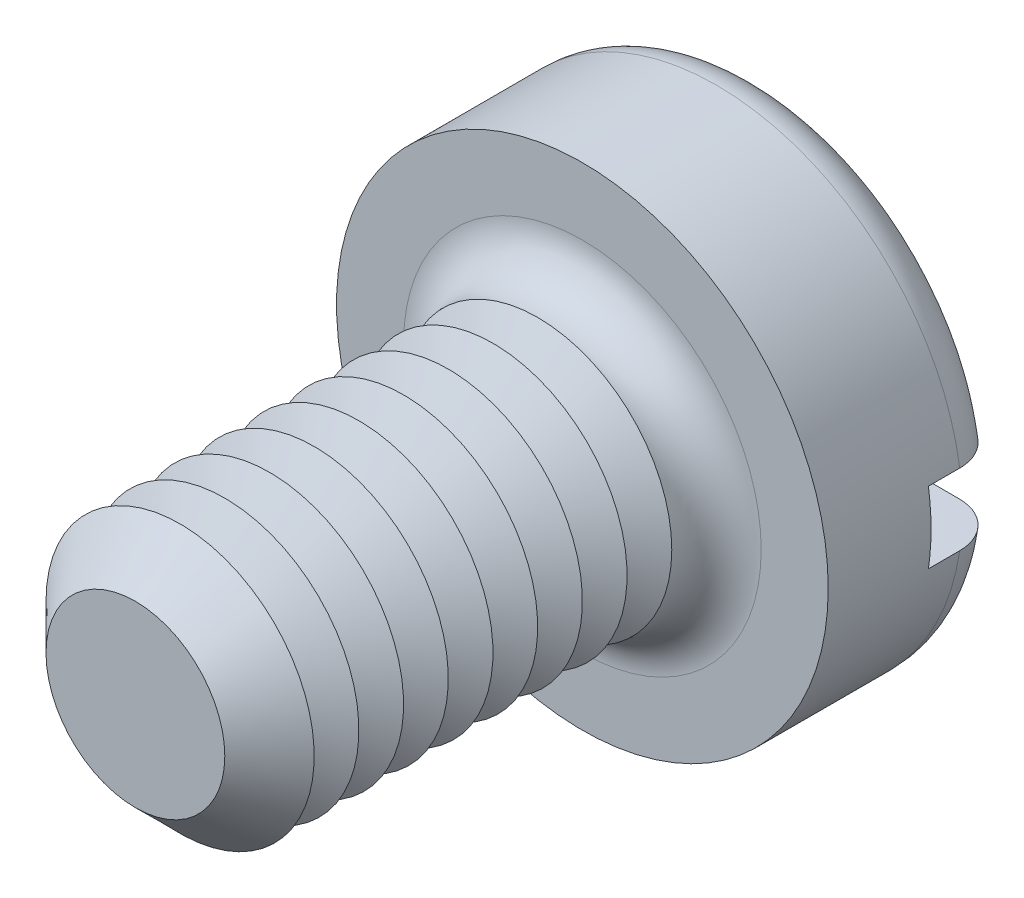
ISO-10303-21;
HEADER;
FILE_DESCRIPTION(('STEP AP214'),'2;1');
FILE_NAME('part.step','',(''),(''),'','','');
FILE_SCHEMA(('AUTOMOTIVE_DESIGN { 1 0 10303 214 1 1 1 1 }'));
ENDSEC;
DATA;
#1=APPLICATION_CONTEXT('core data for automotive mechanical design processes');
#2=APPLICATION_PROTOCOL_DEFINITION('international standard','automotive_design',2000,#1);
#3=PRODUCT_CONTEXT('',#1,'mechanical');
#4=PRODUCT('Part','Part','',(#3));
#5=PRODUCT_RELATED_PRODUCT_CATEGORY('part','',(#4));
#6=PRODUCT_DEFINITION_FORMATION('','',#4);
#7=PRODUCT_DEFINITION_CONTEXT('part definition',#1,'design');
#8=PRODUCT_DEFINITION('design','',#6,#7);
#9=PRODUCT_DEFINITION_SHAPE('','',#8);
#10=(LENGTH_UNIT() NAMED_UNIT(*) SI_UNIT(.MILLI.,.METRE.));
#11=(NAMED_UNIT(*) PLANE_ANGLE_UNIT() SI_UNIT($,.RADIAN.));
#12=(NAMED_UNIT(*) SI_UNIT($,.STERADIAN.) SOLID_ANGLE_UNIT());
#13=UNCERTAINTY_MEASURE_WITH_UNIT(LENGTH_MEASURE(1.E-05),#10,'distance_accuracy_value','');
#14=(GEOMETRIC_REPRESENTATION_CONTEXT(3) GLOBAL_UNCERTAINTY_ASSIGNED_CONTEXT((#13)) GLOBAL_UNIT_ASSIGNED_CONTEXT((#10,
#11,#12)) REPRESENTATION_CONTEXT('',''));
#15=CARTESIAN_POINT('',(0.,0.,0.));
#16=DIRECTION('',(0.,0.,1.));
#17=DIRECTION('',(1.,0.,0.));
#18=AXIS2_PLACEMENT_3D('',#15,#16,#17);
#19=CARTESIAN_POINT('',(0.,0.,-2.));
#20=DIRECTION('',(0.,0.,1.));
#21=DIRECTION('',(1.,0.,0.));
#22=AXIS2_PLACEMENT_3D('',#19,#20,#21);
#23=PLANE('',#22);
#24=CARTESIAN_POINT('',(0.,0.,-2.));
#25=DIRECTION('',(0.,0.,1.));
#26=DIRECTION('',(1.,0.,0.));
#27=AXIS2_PLACEMENT_3D('',#24,#25,#26);
#28=CIRCLE('',#27,2.25);
#29=CARTESIAN_POINT('',(-2.21415898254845,0.4,-2.));
#30=VERTEX_POINT('',#29);
#31=CARTESIAN_POINT('',(2.21415898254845,0.4,-2.));
#32=VERTEX_POINT('',#31);
#33=EDGE_CURVE('E116',#30,#32,#28,.F.);
#34=ORIENTED_EDGE('',*,*,#33,.T.);
#35=DIRECTION('',(1.,0.,0.));
#36=VECTOR('',#35,1.);
#37=CARTESIAN_POINT('',(-2.75,0.400000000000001,-2.));
#38=LINE('',#37,#36);
#39=EDGE_CURVE('E111',#30,#32,#38,.T.);
#40=ORIENTED_EDGE('',*,*,#39,.F.);
#41=EDGE_LOOP('',(#34,#40));
#42=FACE_BOUND('',#41,.T.);
#43=ADVANCED_FACE('F39',(#42),#23,.F.);
#44=CARTESIAN_POINT('',(0.,0.,-1.5));
#45=DIRECTION('',(0.,0.,1.));
#46=DIRECTION('',(1.,0.,0.));
#47=AXIS2_PLACEMENT_3D('',#44,#45,#46);
#48=TOROIDAL_SURFACE('',#47,2.25,0.5);
#49=CARTESIAN_POINT('',(-2.6296588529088,0.400000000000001,-1.78631483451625));
#50=CARTESIAN_POINT('',(-2.61332846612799,0.400000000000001,-1.80942627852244));
#51=CARTESIAN_POINT('',(-2.59501593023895,0.400000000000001,-1.83116426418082));
#52=CARTESIAN_POINT('',(-2.55497423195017,0.400000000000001,-1.87126271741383));
#53=CARTESIAN_POINT('',(-2.53324055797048,0.4,-1.88961865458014));
#54=CARTESIAN_POINT('',(-2.48702796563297,0.4,-1.92241505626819));
#55=CARTESIAN_POINT('',(-2.46255183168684,0.4,-1.93685944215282));
#56=CARTESIAN_POINT('',(-2.41154731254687,0.4,-1.96147315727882));
#57=CARTESIAN_POINT('',(-2.38501943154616,0.4,-1.97164353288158));
#58=CARTESIAN_POINT('',(-2.3303912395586,0.4,-1.98753780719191));
#59=CARTESIAN_POINT('',(-2.30227842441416,0.4,-1.99321871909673));
#60=CARTESIAN_POINT('',(-2.24549884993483,0.4,-1.99984170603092));
#61=CARTESIAN_POINT('',(-2.21683202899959,0.4,-2.00078325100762));
#62=CARTESIAN_POINT('',(-2.15939326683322,0.4,-1.99790249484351));
#63=CARTESIAN_POINT('',(-2.13062419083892,0.4,-1.99402290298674));
#64=CARTESIAN_POINT('',(-2.07413526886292,0.4,-1.98151915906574));
#65=CARTESIAN_POINT('',(-2.04641547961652,0.4,-1.97289475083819));
#66=CARTESIAN_POINT('',(-1.99264697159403,0.4,-1.95107177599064));
#67=CARTESIAN_POINT('',(-1.96660904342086,0.4,-1.93784659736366));
#68=CARTESIAN_POINT('',(-1.91713954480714,0.4,-1.90718730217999));
#69=CARTESIAN_POINT('',(-1.89370795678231,0.4,-1.88975321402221));
#70=CARTESIAN_POINT('',(-1.85029144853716,0.4,-1.85126548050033));
#71=CARTESIAN_POINT('',(-1.83028607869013,0.4,-1.83023492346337));
#72=CARTESIAN_POINT('',(-1.79417432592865,0.4,-1.78505552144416));
#73=CARTESIAN_POINT('',(-1.77806752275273,0.4,-1.76090701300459));
#74=CARTESIAN_POINT('',(-1.75056079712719,0.4,-1.71067721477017));
#75=CARTESIAN_POINT('',(-1.7390748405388,0.4,-1.68464306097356));
#76=CARTESIAN_POINT('',(-1.72075680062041,0.4,-1.63098625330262));
#77=CARTESIAN_POINT('',(-1.71392397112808,0.4,-1.60336385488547));
#78=CARTESIAN_POINT('',(-1.70525661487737,0.4,-1.54801066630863));
#79=CARTESIAN_POINT('',(-1.70330866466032,0.4,-1.52029759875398));
#80=CARTESIAN_POINT('',(-1.70414820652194,0.4,-1.46494458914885));
#81=CARTESIAN_POINT('',(-1.70693532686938,0.4,-1.43730464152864));
#82=CARTESIAN_POINT('',(-1.71709335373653,0.4,-1.38318389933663));
#83=CARTESIAN_POINT('',(-1.72441580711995,0.4,-1.35669397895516));
#84=CARTESIAN_POINT('',(-1.74335830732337,0.4,-1.30529964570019));
#85=CARTESIAN_POINT('',(-1.75497853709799,0.4,-1.2803953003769));
#86=CARTESIAN_POINT('',(-1.78229453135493,0.4,-1.23258298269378));
#87=CARTESIAN_POINT('',(-1.79803217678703,0.4,-1.20969896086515));
#88=CARTESIAN_POINT('',(-1.83304498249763,0.4,-1.16682064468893));
#89=CARTESIAN_POINT('',(-1.85232054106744,0.4,-1.1468266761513));
#90=CARTESIAN_POINT('',(-1.89433695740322,0.4,-1.10980713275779));
#91=CARTESIAN_POINT('',(-1.91714740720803,0.4,-1.09286053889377));
#92=CARTESIAN_POINT('',(-1.96524407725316,0.4,-1.06294809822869));
#93=CARTESIAN_POINT('',(-1.99053056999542,0.4,-1.04998269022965));
#94=CARTESIAN_POINT('',(-2.04340612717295,0.4,-1.02814800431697));
#95=CARTESIAN_POINT('',(-2.07103098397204,0.4,-1.01936532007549));
#96=CARTESIAN_POINT('',(-2.12735840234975,0.4,-1.00652373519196));
#97=CARTESIAN_POINT('',(-2.15606102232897,0.4,-1.00246509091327));
#98=CARTESIAN_POINT('',(-2.21395379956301,0.4,-0.999181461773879));
#99=CARTESIAN_POINT('',(-2.24314598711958,0.4,-0.999992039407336));
#100=CARTESIAN_POINT('',(-2.30097585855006,0.4,-1.00652779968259));
#101=CARTESIAN_POINT('',(-2.32961355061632,0.4,-1.01225290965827));
#102=CARTESIAN_POINT('',(-2.38536238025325,0.4,-1.02843951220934));
#103=CARTESIAN_POINT('',(-2.41248047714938,0.4,-1.03887701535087));
#104=CARTESIAN_POINT('',(-2.46454860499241,0.4,-1.06421009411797));
#105=CARTESIAN_POINT('',(-2.48949875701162,0.4,-1.0791054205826));
#106=CARTESIAN_POINT('',(-2.53620471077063,0.4,-1.11274531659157));
#107=CARTESIAN_POINT('',(-2.55799482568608,0.400000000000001,-1.1314422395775));
#108=CARTESIAN_POINT('',(-2.59807595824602,0.400000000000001,-1.17227176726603));
#109=CARTESIAN_POINT('',(-2.6163672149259,0.400000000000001,-1.19440413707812));
#110=CARTESIAN_POINT('',(-2.64868581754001,0.400000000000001,-1.24117072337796));
#111=CARTESIAN_POINT('',(-2.66276466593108,0.400000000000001,-1.26576935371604));
#112=CARTESIAN_POINT('',(-2.68654482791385,0.400000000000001,-1.31699754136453));
#113=CARTESIAN_POINT('',(-2.69624657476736,0.400000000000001,-1.34362689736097));
#114=CARTESIAN_POINT('',(-2.71090527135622,0.400000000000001,-1.39787706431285));
#115=CARTESIAN_POINT('',(-2.71590826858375,0.400000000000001,-1.4254854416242));
#116=CARTESIAN_POINT('',(-2.72118463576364,0.400000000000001,-1.48115803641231));
#117=CARTESIAN_POINT('',(-2.72145696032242,0.400000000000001,-1.50922235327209));
#118=CARTESIAN_POINT('',(-2.71727180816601,0.400000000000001,-1.56487271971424));
#119=CARTESIAN_POINT('',(-2.71283440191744,0.400000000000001,-1.59246029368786));
#120=CARTESIAN_POINT('',(-2.69939521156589,0.400000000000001,-1.64647499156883));
#121=CARTESIAN_POINT('',(-2.69039909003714,0.400000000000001,-1.67290351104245));
#122=CARTESIAN_POINT('',(-2.67251693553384,0.400000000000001,-1.71382731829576));
#123=CARTESIAN_POINT('',(-2.66497994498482,0.400000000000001,-1.72892686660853));
#124=CARTESIAN_POINT('',(-2.64841616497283,0.400000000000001,-1.75828509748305));
#125=CARTESIAN_POINT('',(-2.63938938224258,0.400000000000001,-1.77254378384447));
#126=CARTESIAN_POINT('',(-2.6296588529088,0.400000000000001,-1.78631483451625));
#127=B_SPLINE_CURVE_WITH_KNOTS('',3,(#49,#50,#51,#52,#53,#54,#55,#56,#57,#58,#59,#60,#61,#62,
#63,#64,#65,#66,#67,#68,#69,#70,#71,#72,#73,#74,#75,#76,#77,#78,#79,#80,#81,#82,#83,#84,#85,#86,
#87,#88,#89,#90,#91,#92,#93,#94,#95,#96,#97,#98,#99,#100,#101,#102,#103,#104,#105,#106,#107,
#108,#109,#110,#111,#112,#113,#114,#115,#116,#117,#118,#119,#120,#121,#122,#123,#124,#125,#126),
.UNSPECIFIED.,.T.,.F.,(4,2,2,2,2,2,2,2,2,2,2,2,2,2,2,2,2,2,2,2,2,2,2,2,2,2,2,2,2,2,2,2,2,2,2,2,
2,2,4),(0.,0.0848338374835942,0.16978050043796,0.254641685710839,0.339482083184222,
0.42512530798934,0.510778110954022,0.597458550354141,0.684143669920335,0.771338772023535,
0.858533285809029,0.945187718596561,1.03183280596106,1.11678035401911,1.20171427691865,
1.28465703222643,1.36759327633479,1.4496584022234,1.53172702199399,1.61466526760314,
1.69761285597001,1.78247103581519,1.86733856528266,1.95389396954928,2.0404540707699,
2.12764713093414,2.21483890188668,2.30159172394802,2.38833969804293,2.4740609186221,
2.55977628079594,2.6443962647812,2.72900787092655,2.81278135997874,2.89657336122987,
2.98000971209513,3.06334267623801,3.113891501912,3.16444009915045),.UNSPECIFIED.);
#128=CARTESIAN_POINT('',(-2.72075357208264,0.400000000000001,-1.50000000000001));
#129=VERTEX_POINT('',#128);
#130=EDGE_CURVE('E243',#129,#30,#127,.T.);
#131=ORIENTED_EDGE('',*,*,#130,.F.);
#132=CARTESIAN_POINT('',(0.,0.,-1.5));
#133=DIRECTION('',(0.,0.,1.));
#134=DIRECTION('',(1.,0.,0.));
#135=AXIS2_PLACEMENT_3D('',#132,#133,#134);
#136=CIRCLE('',#135,2.75);
#137=CARTESIAN_POINT('',(2.7207535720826,0.4,-1.5));
#138=VERTEX_POINT('',#137);
#139=EDGE_CURVE('E125',#138,#129,#136,.T.);
#140=ORIENTED_EDGE('',*,*,#139,.F.);
#141=CARTESIAN_POINT('',(1.7362507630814,0.4,-1.6752840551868));
#142=CARTESIAN_POINT('',(1.74636083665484,0.4,-1.70159961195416));
#143=CARTESIAN_POINT('',(1.7587429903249,0.4,-1.72706707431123));
#144=CARTESIAN_POINT('',(1.78764414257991,0.4,-1.77556609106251));
#145=CARTESIAN_POINT('',(1.80416918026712,0.4,-1.79859401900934));
#146=CARTESIAN_POINT('',(1.84080454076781,0.4,-1.84153587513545));
#147=CARTESIAN_POINT('',(1.86090949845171,0.4,-1.86145438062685));
#148=CARTESIAN_POINT('',(1.9041208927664,0.4,-1.89769607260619));
#149=CARTESIAN_POINT('',(1.92722659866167,0.4,-1.91402013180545));
#150=CARTESIAN_POINT('',(1.97620958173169,0.4,-1.94291288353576));
#151=CARTESIAN_POINT('',(2.00212726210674,0.4,-1.95541309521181));
#152=CARTESIAN_POINT('',(2.05567603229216,0.4,-1.97595143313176));
#153=CARTESIAN_POINT('',(2.08330733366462,0.4,-1.98398900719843));
#154=CARTESIAN_POINT('',(2.13989163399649,0.4,-1.99545904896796));
#155=CARTESIAN_POINT('',(2.16885726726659,0.4,-1.99882930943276));
#156=CARTESIAN_POINT('',(2.22694412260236,0.4,-2.00065872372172));
#157=CARTESIAN_POINT('',(2.25606534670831,0.4,-1.99911781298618));
#158=CARTESIAN_POINT('',(2.31362436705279,0.4,-1.99114818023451));
#159=CARTESIAN_POINT('',(2.34206235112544,0.4,-1.98472081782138));
#160=CARTESIAN_POINT('',(2.39743709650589,0.4,-1.96713601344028));
#161=CARTESIAN_POINT('',(2.42437392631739,0.4,-1.95597878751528));
#162=CARTESIAN_POINT('',(2.47569769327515,0.4,-1.92935960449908));
#163=CARTESIAN_POINT('',(2.50010686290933,0.4,-1.91394052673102));
#164=CARTESIAN_POINT('',(2.54594525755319,0.4,-1.8791725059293));
#165=CARTESIAN_POINT('',(2.56737468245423,0.4,-1.85982382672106));
#166=CARTESIAN_POINT('',(2.60634898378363,0.4,-1.81801641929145));
#167=CARTESIAN_POINT('',(2.6239407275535,0.4,-1.79560138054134));
#168=CARTESIAN_POINT('',(2.65505953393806,0.4,-1.7481077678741));
#169=CARTESIAN_POINT('',(2.66858686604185,0.4,-1.72302937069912));
#170=CARTESIAN_POINT('',(2.69103536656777,0.4,-1.67123055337));
#171=CARTESIAN_POINT('',(2.70000740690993,0.4,-1.64453217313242));
#172=CARTESIAN_POINT('',(2.71330608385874,0.4,-1.59000262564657));
#173=CARTESIAN_POINT('',(2.71763293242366,0.4,-1.5621715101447));
#174=CARTESIAN_POINT('',(2.72149675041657,0.4,-1.50637655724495));
#175=CARTESIAN_POINT('',(2.72106725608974,0.4,-1.47841503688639));
#176=CARTESIAN_POINT('',(2.7155123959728,0.4,-1.42296287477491));
#177=CARTESIAN_POINT('',(2.71038711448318,0.4,-1.39547222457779));
#178=CARTESIAN_POINT('',(2.69560462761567,0.4,-1.34178071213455));
#179=CARTESIAN_POINT('',(2.68595389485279,0.4,-1.31557806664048));
#180=CARTESIAN_POINT('',(2.66240876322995,0.4,-1.26515516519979));
#181=CARTESIAN_POINT('',(2.64851431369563,0.4,-1.24093493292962));
#182=CARTESIAN_POINT('',(2.61681930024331,0.4,-1.19504594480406));
#183=CARTESIAN_POINT('',(2.59900198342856,0.4,-1.17338876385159));
#184=CARTESIAN_POINT('',(2.56001495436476,0.4,-1.13333899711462));
#185=CARTESIAN_POINT('',(2.53884510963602,0.4,-1.11494654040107));
#186=CARTESIAN_POINT('',(2.49354554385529,0.4,-1.08175888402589));
#187=CARTESIAN_POINT('',(2.46938991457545,0.4,-1.06699905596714));
#188=CARTESIAN_POINT('',(2.41896725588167,0.4,-1.04168682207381));
#189=CARTESIAN_POINT('',(2.39270009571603,0.4,-1.03113467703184));
#190=CARTESIAN_POINT('',(2.33844927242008,0.4,-1.01439607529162));
#191=CARTESIAN_POINT('',(2.31044823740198,0.4,-1.00826592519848));
#192=CARTESIAN_POINT('',(2.25381752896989,0.4,-1.00073183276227));
#193=CARTESIAN_POINT('',(2.22518781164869,0.4,-0.999328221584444));
#194=CARTESIAN_POINT('',(2.16774231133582,0.4,-1.00127811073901));
#195=CARTESIAN_POINT('',(2.13892848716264,0.4,-1.00468955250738));
#196=CARTESIAN_POINT('',(2.08227193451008,0.4,-1.01626887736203));
#197=CARTESIAN_POINT('',(2.05442926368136,0.4,-1.02443704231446));
#198=CARTESIAN_POINT('',(2.00032604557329,0.4,-1.04537295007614));
#199=CARTESIAN_POINT('',(1.97407661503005,0.4,-1.05816944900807));
#200=CARTESIAN_POINT('',(1.92411255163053,0.4,-1.08801035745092));
#201=CARTESIAN_POINT('',(1.90039792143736,0.4,-1.10505477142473));
#202=CARTESIAN_POINT('',(1.85633574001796,0.4,-1.14282887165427));
#203=CARTESIAN_POINT('',(1.83597040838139,0.4,-1.16353779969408));
#204=CARTESIAN_POINT('',(1.79908731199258,0.4,-1.20813793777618));
#205=CARTESIAN_POINT('',(1.78256899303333,0.4,-1.23202868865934));
#206=CARTESIAN_POINT('',(1.75420022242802,0.4,-1.28183173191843));
#207=CARTESIAN_POINT('',(1.74226635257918,0.4,-1.30769648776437));
#208=CARTESIAN_POINT('',(1.72302798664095,0.4,-1.36110211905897));
#209=CARTESIAN_POINT('',(1.71572395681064,0.4,-1.38864316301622));
#210=CARTESIAN_POINT('',(1.70611974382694,0.4,-1.44392326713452));
#211=CARTESIAN_POINT('',(1.70370764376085,0.4,-1.47164298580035));
#212=CARTESIAN_POINT('',(1.70363822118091,0.4,-1.52706336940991));
#213=CARTESIAN_POINT('',(1.70597448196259,0.4,-1.55476400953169));
#214=CARTESIAN_POINT('',(1.71335146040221,0.4,-1.59796127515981));
#215=CARTESIAN_POINT('',(1.71686033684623,0.4,-1.61373520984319));
#216=CARTESIAN_POINT('',(1.7254146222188,0.4,-1.64486018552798));
#217=CARTESIAN_POINT('',(1.73045999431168,0.4,-1.66021123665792));
#218=CARTESIAN_POINT('',(1.7362507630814,0.4,-1.6752840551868));
#219=B_SPLINE_CURVE_WITH_KNOTS('',3,(#141,#142,#143,#144,#145,#146,#147,#148,#149,#150,#151,
#152,#153,#154,#155,#156,#157,#158,#159,#160,#161,#162,#163,#164,#165,#166,#167,#168,#169,#170,
#171,#172,#173,#174,#175,#176,#177,#178,#179,#180,#181,#182,#183,#184,#185,#186,#187,#188,#189,
#190,#191,#192,#193,#194,#195,#196,#197,#198,#199,#200,#201,#202,#203,#204,#205,#206,#207,#208,
#209,#210,#211,#212,#213,#214,#215,#216,#217,#218),.UNSPECIFIED.,.T.,.F.,(4,2,2,2,2,2,2,2,2,2,2,
2,2,2,2,2,2,2,2,2,2,2,2,2,2,2,2,2,2,2,2,2,2,2,2,2,2,2,4),(0.,0.0845117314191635,
0.169147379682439,0.253657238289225,0.338146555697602,0.424070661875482,0.510005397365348,
0.597074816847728,0.684145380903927,0.771191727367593,0.858234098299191,0.94443074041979,
1.03062159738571,1.11569223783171,1.20075723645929,1.28485012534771,1.36893917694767,
1.45243570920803,1.53593074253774,1.61930671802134,1.70268368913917,1.7864238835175,
1.87016738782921,1.95469664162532,2.03923113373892,2.12482389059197,2.21042264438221,
2.29706026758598,2.38370302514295,2.47089361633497,2.55808429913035,2.64479602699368,
2.73149525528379,2.81653234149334,2.9015779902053,2.98465497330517,3.06761976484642,
3.11602689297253,3.164432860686),.UNSPECIFIED.);
#220=EDGE_CURVE('E245',#32,#138,#219,.T.);
#221=ORIENTED_EDGE('',*,*,#220,.F.);
#222=ORIENTED_EDGE('',*,*,#33,.F.);
#223=EDGE_LOOP('',(#131,#140,#221,#222));
#224=FACE_BOUND('',#223,.T.);
#225=ADVANCED_FACE('F227',(#224),#48,.T.);
#226=CARTESIAN_POINT('',(0.,0.,-2.));
#227=DIRECTION('',(0.,0.,1.));
#228=DIRECTION('',(1.,0.,0.));
#229=AXIS2_PLACEMENT_3D('',#226,#227,#228);
#230=CYLINDRICAL_SURFACE('',#229,2.75);
#231=DIRECTION('',(0.,0.,1.));
#232=VECTOR('',#231,1.);
#233=CARTESIAN_POINT('',(2.72075357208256,0.4,-2.));
#234=LINE('',#233,#232);
#235=CARTESIAN_POINT('',(2.72075357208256,0.4,-1.15));
#236=VERTEX_POINT('',#235);
#237=EDGE_CURVE('E259',#138,#236,#234,.T.);
#238=ORIENTED_EDGE('',*,*,#237,.F.);
#239=ORIENTED_EDGE('',*,*,#139,.T.);
#240=DIRECTION('',(0.,0.,1.));
#241=VECTOR('',#240,1.);
#242=CARTESIAN_POINT('',(-2.72075357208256,0.4,-2.));
#243=LINE('',#242,#241);
#244=CARTESIAN_POINT('',(-2.72075357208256,0.4,-1.15));
#245=VERTEX_POINT('',#244);
#246=EDGE_CURVE('E63',#245,#129,#243,.F.);
#247=ORIENTED_EDGE('',*,*,#246,.F.);
#248=CARTESIAN_POINT('',(0.,0.,-1.15));
#249=DIRECTION('',(0.,0.,-1.));
#250=DIRECTION('',(-1.,0.,0.));
#251=AXIS2_PLACEMENT_3D('',#248,#249,#250);
#252=CIRCLE('',#251,2.75);
#253=CARTESIAN_POINT('',(-2.72075357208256,-0.4,-1.15));
#254=VERTEX_POINT('',#253);
#255=EDGE_CURVE('E43',#245,#254,#252,.F.);
#256=ORIENTED_EDGE('',*,*,#255,.T.);
#257=DIRECTION('',(0.,0.,1.));
#258=VECTOR('',#257,1.);
#259=CARTESIAN_POINT('',(-2.72075357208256,-0.4,-2.));
#260=LINE('',#259,#258);
#261=CARTESIAN_POINT('',(-2.72075357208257,-0.4,-1.5));
#262=VERTEX_POINT('',#261);
#263=EDGE_CURVE('E256',#262,#254,#260,.T.);
#264=ORIENTED_EDGE('',*,*,#263,.F.);
#265=CARTESIAN_POINT('',(2.72075357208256,-0.4,-1.5));
#266=VERTEX_POINT('',#265);
#267=EDGE_CURVE('E127',#262,#266,#136,.T.);
#268=ORIENTED_EDGE('',*,*,#267,.T.);
#269=DIRECTION('',(0.,0.,1.));
#270=VECTOR('',#269,1.);
#271=CARTESIAN_POINT('',(2.72075357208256,-0.4,-2.));
#272=LINE('',#271,#270);
#273=CARTESIAN_POINT('',(2.72075357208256,-0.4,-1.15));
#274=VERTEX_POINT('',#273);
#275=EDGE_CURVE('E55',#274,#266,#272,.F.);
#276=ORIENTED_EDGE('',*,*,#275,.F.);
#277=EDGE_CURVE('E11',#274,#236,#252,.F.);
#278=ORIENTED_EDGE('',*,*,#277,.T.);
#279=EDGE_LOOP('',(#238,#239,#247,#256,#264,#268,#276,#278));
#280=FACE_BOUND('',#279,.T.);
#281=CARTESIAN_POINT('',(0.,0.,0.));
#282=DIRECTION('',(0.,0.,1.));
#283=DIRECTION('',(1.,0.,0.));
#284=AXIS2_PLACEMENT_3D('',#281,#282,#283);
#285=CIRCLE('',#284,2.75);
#286=CARTESIAN_POINT('',(2.75,0.,0.));
#287=VERTEX_POINT('',#286);
#288=EDGE_CURVE('E262',#287,#287,#285,.T.);
#289=ORIENTED_EDGE('',*,*,#288,.F.);
#290=EDGE_LOOP('',(#289));
#291=FACE_BOUND('',#290,.T.);
#292=ADVANCED_FACE('F223',(#280,#291),#230,.T.);
#293=CARTESIAN_POINT('',(2.21415898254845,-0.4,-2.));
#294=VERTEX_POINT('',#293);
#295=CARTESIAN_POINT('',(-2.21415898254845,-0.4,-2.));
#296=VERTEX_POINT('',#295);
#297=EDGE_CURVE('E109',#294,#296,#28,.F.);
#298=ORIENTED_EDGE('',*,*,#297,.T.);
#299=DIRECTION('',(-1.,0.,0.));
#300=VECTOR('',#299,1.);
#301=CARTESIAN_POINT('',(-2.75,-0.4,-2.));
#302=LINE('',#301,#300);
#303=EDGE_CURVE('E96',#294,#296,#302,.T.);
#304=ORIENTED_EDGE('',*,*,#303,.F.);
#305=EDGE_LOOP('',(#298,#304));
#306=FACE_BOUND('',#305,.T.);
#307=ADVANCED_FACE('F108',(#306),#23,.F.);
#308=CARTESIAN_POINT('',(0.,0.,0.));
#309=DIRECTION('',(0.,0.,1.));
#310=DIRECTION('',(1.,0.,0.));
#311=AXIS2_PLACEMENT_3D('',#308,#309,#310);
#312=PLANE('',#311);
#313=CARTESIAN_POINT('',(0.,0.,0.));
#314=DIRECTION('',(0.,0.,1.));
#315=DIRECTION('',(1.,0.,0.));
#316=AXIS2_PLACEMENT_3D('',#313,#314,#315);
#317=CIRCLE('',#316,2.);
#318=CARTESIAN_POINT('',(2.,0.,0.));
#319=VERTEX_POINT('',#318);
#320=EDGE_CURVE('E115',#319,#319,#317,.F.);
#321=ORIENTED_EDGE('',*,*,#320,.T.);
#322=EDGE_LOOP('',(#321));
#323=FACE_BOUND('',#322,.T.);
#324=ORIENTED_EDGE('',*,*,#288,.T.);
#325=EDGE_LOOP('',(#324));
#326=FACE_BOUND('',#325,.T.);
#327=ADVANCED_FACE('F222',(#323,#326),#312,.T.);
#328=CARTESIAN_POINT('',(-2.6296588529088,-0.4,-1.78631483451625));
#329=CARTESIAN_POINT('',(-2.64575286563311,-0.4,-1.76353353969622));
#330=CARTESIAN_POINT('',(-2.65994473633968,-0.4,-1.73938506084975));
#331=CARTESIAN_POINT('',(-2.68408879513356,-0.4,-1.68903091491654));
#332=CARTESIAN_POINT('',(-2.69403633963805,-0.4,-1.6628230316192));
#333=CARTESIAN_POINT('',(-2.70937899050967,-0.4,-1.60911025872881));
#334=CARTESIAN_POINT('',(-2.71477511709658,-0.4,-1.5816056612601));
#335=CARTESIAN_POINT('',(-2.72085365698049,-0.4,-1.52608718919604));
#336=CARTESIAN_POINT('',(-2.7215371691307,-0.4,-1.49807343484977));
#337=CARTESIAN_POINT('',(-2.71817903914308,-0.4,-1.44242333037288));
#338=CARTESIAN_POINT('',(-2.71415291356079,-0.4,-1.41478604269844));
#339=CARTESIAN_POINT('',(-2.70152104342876,-0.4,-1.36057835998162));
#340=CARTESIAN_POINT('',(-2.69291517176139,-0.4,-1.33400799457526));
#341=CARTESIAN_POINT('',(-2.67137052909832,-0.4,-1.28266198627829));
#342=CARTESIAN_POINT('',(-2.65842829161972,-0.4,-1.25788779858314));
#343=CARTESIAN_POINT('',(-2.62859348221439,-0.4,-1.21084577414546));
#344=CARTESIAN_POINT('',(-2.61170082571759,-0.4,-1.18857799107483));
#345=CARTESIAN_POINT('',(-2.5743351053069,-0.4,-1.1470221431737));
#346=CARTESIAN_POINT('',(-2.55383974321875,-0.4,-1.12775413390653));
#347=CARTESIAN_POINT('',(-2.5099353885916,-0.4,-1.09288845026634));
#348=CARTESIAN_POINT('',(-2.48652625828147,-0.4,-1.07729094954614));
#349=CARTESIAN_POINT('',(-2.43718903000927,-0.4,-1.0500239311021));
#350=CARTESIAN_POINT('',(-2.41123629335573,-0.4,-1.0383990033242));
#351=CARTESIAN_POINT('',(-2.35776417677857,-0.4,-1.01960886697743));
#352=CARTESIAN_POINT('',(-2.33024469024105,-0.4,-1.01244396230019));
#353=CARTESIAN_POINT('',(-2.27404134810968,-0.4,-1.00268156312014));
#354=CARTESIAN_POINT('',(-2.24534705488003,-0.4,-1.00014414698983));
#355=CARTESIAN_POINT('',(-2.18793513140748,-0.4,-0.999867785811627));
#356=CARTESIAN_POINT('',(-2.15921749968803,-0.4,-1.00212917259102));
#357=CARTESIAN_POINT('',(-2.10225052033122,-0.4,-1.01142552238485));
#358=CARTESIAN_POINT('',(-2.07400941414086,-0.4,-1.01851105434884));
#359=CARTESIAN_POINT('',(-2.01911044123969,-0.4,-1.03730994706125));
#360=CARTESIAN_POINT('',(-1.99245264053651,-0.4,-1.04902350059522));
#361=CARTESIAN_POINT('',(-1.94142108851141,-0.4,-1.07679847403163));
#362=CARTESIAN_POINT('',(-1.91705303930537,-0.4,-1.09287038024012));
#363=CARTESIAN_POINT('',(-1.87139758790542,-0.4,-1.12891897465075));
#364=CARTESIAN_POINT('',(-1.85011007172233,-0.4,-1.14889551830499));
#365=CARTESIAN_POINT('',(-1.81149058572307,-0.4,-1.19196940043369));
#366=CARTESIAN_POINT('',(-1.79411779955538,-0.4,-1.21503011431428));
#367=CARTESIAN_POINT('',(-1.76359546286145,-0.4,-1.26379588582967));
#368=CARTESIAN_POINT('',(-1.75044532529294,-0.4,-1.28950057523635));
#369=CARTESIAN_POINT('',(-1.72906221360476,-0.4,-1.3422057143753));
#370=CARTESIAN_POINT('',(-1.72072512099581,-0.4,-1.3691639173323));
#371=CARTESIAN_POINT('',(-1.70880448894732,-0.4,-1.42411084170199));
#372=CARTESIAN_POINT('',(-1.7052202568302,-0.4,-1.45209941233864));
#373=CARTESIAN_POINT('',(-1.70295553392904,-0.4,-1.50768522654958));
#374=CARTESIAN_POINT('',(-1.70417398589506,-0.4,-1.53527840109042));
#375=CARTESIAN_POINT('',(-1.71124536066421,-0.4,-1.58986292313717));
#376=CARTESIAN_POINT('',(-1.71709811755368,-0.4,-1.61685429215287));
#377=CARTESIAN_POINT('',(-1.73321132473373,-0.4,-1.66938107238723));
#378=CARTESIAN_POINT('',(-1.74345625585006,-0.4,-1.69492125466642));
#379=CARTESIAN_POINT('',(-1.76802111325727,-0.4,-1.74395877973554));
#380=CARTESIAN_POINT('',(-1.78234133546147,-0.4,-1.76745597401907));
#381=CARTESIAN_POINT('',(-1.81488631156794,-0.4,-1.81216193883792));
#382=CARTESIAN_POINT('',(-1.83317116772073,-0.4,-1.83332693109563));
#383=CARTESIAN_POINT('',(-1.87296030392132,-0.4,-1.872375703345));
#384=CARTESIAN_POINT('',(-1.89446497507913,-0.4,-1.89025908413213));
#385=CARTESIAN_POINT('',(-1.94063077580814,-0.4,-1.92267732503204));
#386=CARTESIAN_POINT('',(-1.96535444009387,-0.4,-1.93712316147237));
#387=CARTESIAN_POINT('',(-2.01684705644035,-0.4,-1.96173690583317));
#388=CARTESIAN_POINT('',(-2.04361620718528,-0.4,-1.97190439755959));
#389=CARTESIAN_POINT('',(-2.09891021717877,-0.4,-1.9878230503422));
#390=CARTESIAN_POINT('',(-2.12745653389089,-0.4,-1.99349978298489));
#391=CARTESIAN_POINT('',(-2.18509639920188,-0.4,-1.99999556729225));
#392=CARTESIAN_POINT('',(-2.21418994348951,-0.4,-2.00081465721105));
#393=CARTESIAN_POINT('',(-2.27218032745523,-0.4,-1.99755156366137));
#394=CARTESIAN_POINT('',(-2.30107643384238,-0.4,-1.99345627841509));
#395=CARTESIAN_POINT('',(-2.35776697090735,-0.4,-1.98043125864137));
#396=CARTESIAN_POINT('',(-2.38556116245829,-0.4,-1.97150048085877));
#397=CARTESIAN_POINT('',(-2.43901832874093,-0.4,-1.94912081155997));
#398=CARTESIAN_POINT('',(-2.46469578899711,-0.4,-1.93570648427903));
#399=CARTESIAN_POINT('',(-2.51337022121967,-0.4,-1.90471183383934));
#400=CARTESIAN_POINT('',(-2.53637056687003,-0.4,-1.88713684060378));
#401=CARTESIAN_POINT('',(-2.57111030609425,-0.4,-1.85552084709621));
#402=CARTESIAN_POINT('',(-2.58386709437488,-0.4,-1.84257896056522));
#403=CARTESIAN_POINT('',(-2.60790410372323,-0.4,-1.81538935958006));
#404=CARTESIAN_POINT('',(-2.61918433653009,-0.4,-1.80114165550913));
#405=CARTESIAN_POINT('',(-2.6296588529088,-0.4,-1.78631483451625));
#406=B_SPLINE_CURVE_WITH_KNOTS('',3,(#328,#329,#330,#331,#332,#333,#334,#335,#336,#337,#338,
#339,#340,#341,#342,#343,#344,#345,#346,#347,#348,#349,#350,#351,#352,#353,#354,#355,#356,#357,
#358,#359,#360,#361,#362,#363,#364,#365,#366,#367,#368,#369,#370,#371,#372,#373,#374,#375,#376,
#377,#378,#379,#380,#381,#382,#383,#384,#385,#386,#387,#388,#389,#390,#391,#392,#393,#394,#395,
#396,#397,#398,#399,#400,#401,#402,#403,#404,#405),.UNSPECIFIED.,.T.,.F.,(4,2,2,2,2,2,2,2,2,2,2,
2,2,2,2,2,2,2,2,2,2,2,2,2,2,2,2,2,2,2,2,2,2,2,2,2,2,2,4),(0.,0.0836125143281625,
0.167316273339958,0.251001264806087,0.334666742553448,0.418057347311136,0.501450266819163,
0.584910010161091,0.668371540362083,0.752369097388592,0.836370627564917,0.921286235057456,
1.00620762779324,1.09222390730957,1.17824613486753,1.26518425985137,1.35212600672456,
1.43927882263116,1.52642841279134,1.61262232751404,1.69880425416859,1.7830443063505,
1.86727208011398,1.9497371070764,2.03219918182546,2.1143722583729,2.19655130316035,
2.28007615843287,2.36361116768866,2.44911836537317,2.53463387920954,2.62153862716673,
2.70844269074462,2.79557895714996,2.88273403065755,2.96923214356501,3.05562004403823,
3.11003826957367,3.16445606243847),.UNSPECIFIED.);
#407=EDGE_CURVE('E103',#296,#262,#406,.T.);
#408=ORIENTED_EDGE('',*,*,#407,.F.);
#409=ORIENTED_EDGE('',*,*,#297,.F.);
#410=CARTESIAN_POINT('',(1.7362507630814,-0.4,-1.6752840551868));
#411=CARTESIAN_POINT('',(1.72641416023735,-0.4,-1.64967314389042));
#412=CARTESIAN_POINT('',(1.71871480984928,-0.4,-1.62322216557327));
#413=CARTESIAN_POINT('',(1.70786038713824,-0.4,-1.56938399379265));
#414=CARTESIAN_POINT('',(1.70470970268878,-0.4,-1.54199592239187));
#415=CARTESIAN_POINT('',(1.70306971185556,-0.4,-1.48708393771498));
#416=CARTESIAN_POINT('',(1.70457942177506,-0.4,-1.45956005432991));
#417=CARTESIAN_POINT('',(1.71220670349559,-0.4,-1.40516538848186));
#418=CARTESIAN_POINT('',(1.71832341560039,-0.4,-1.3782944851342));
#419=CARTESIAN_POINT('',(1.73494792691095,-0.4,-1.32598312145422));
#420=CARTESIAN_POINT('',(1.74545076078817,-0.4,-1.30054108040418));
#421=CARTESIAN_POINT('',(1.77051013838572,-0.4,-1.25173932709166));
#422=CARTESIAN_POINT('',(1.7850670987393,-0.4,-1.22837982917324));
#423=CARTESIAN_POINT('',(1.81806903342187,-0.4,-1.1839775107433));
#424=CARTESIAN_POINT('',(1.8365752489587,-0.4,-1.16298023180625));
#425=CARTESIAN_POINT('',(1.87677669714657,-0.4,-1.1243010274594));
#426=CARTESIAN_POINT('',(1.89847230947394,-0.4,-1.10661949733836));
#427=CARTESIAN_POINT('',(1.94498854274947,-0.4,-1.07463966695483));
#428=CARTESIAN_POINT('',(1.96987078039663,-0.4,-1.06043095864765));
#429=CARTESIAN_POINT('',(2.02163980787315,-0.4,-1.0363161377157));
#430=CARTESIAN_POINT('',(2.04852678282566,-0.4,-1.02641042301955));
#431=CARTESIAN_POINT('',(2.10400319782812,-0.4,-1.01104128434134));
#432=CARTESIAN_POINT('',(2.13261287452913,-0.4,-1.00565079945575));
#433=CARTESIAN_POINT('',(2.19033179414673,-0.4,-0.999735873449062));
#434=CARTESIAN_POINT('',(2.2194410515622,-0.4,-0.999211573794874));
#435=CARTESIAN_POINT('',(2.27740442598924,-0.4,-1.00306591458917));
#436=CARTESIAN_POINT('',(2.30625777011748,-0.4,-1.00745623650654));
#437=CARTESIAN_POINT('',(2.36280530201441,-0.4,-1.02105937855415));
#438=CARTESIAN_POINT('',(2.39049952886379,-0.4,-1.03027203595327));
#439=CARTESIAN_POINT('',(2.44369359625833,-0.4,-1.05318710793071));
#440=CARTESIAN_POINT('',(2.46920965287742,-0.4,-1.0668518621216));
#441=CARTESIAN_POINT('',(2.51754507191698,-0.4,-1.09832423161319));
#442=CARTESIAN_POINT('',(2.54036461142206,-0.4,-1.11613157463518));
#443=CARTESIAN_POINT('',(2.58234752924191,-0.4,-1.15513986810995));
#444=CARTESIAN_POINT('',(2.601553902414,-0.4,-1.1762945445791));
#445=CARTESIAN_POINT('',(2.63609001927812,-0.4,-1.22156192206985));
#446=CARTESIAN_POINT('',(2.65142002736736,-0.4,-1.24567442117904));
#447=CARTESIAN_POINT('',(2.67757733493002,-0.4,-1.29585881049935));
#448=CARTESIAN_POINT('',(2.68845668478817,-0.4,-1.32190357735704));
#449=CARTESIAN_POINT('',(2.7056478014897,-0.4,-1.375459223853));
#450=CARTESIAN_POINT('',(2.71195980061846,-0.4,-1.40297002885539));
#451=CARTESIAN_POINT('',(2.71979288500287,-0.4,-1.45843707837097));
#452=CARTESIAN_POINT('',(2.72135241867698,-0.4,-1.48638789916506));
#453=CARTESIAN_POINT('',(2.71974298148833,-0.4,-1.54215266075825));
#454=CARTESIAN_POINT('',(2.71657412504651,-0.4,-1.56996660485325));
#455=CARTESIAN_POINT('',(2.70561779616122,-0.4,-1.62459191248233));
#456=CARTESIAN_POINT('',(2.69784258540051,-0.4,-1.65140573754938));
#457=CARTESIAN_POINT('',(2.6779146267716,-0.4,-1.70335337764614));
#458=CARTESIAN_POINT('',(2.66576185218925,-0.4,-1.72848718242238));
#459=CARTESIAN_POINT('',(2.63739107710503,-0.4,-1.77645196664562));
#460=CARTESIAN_POINT('',(2.62116029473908,-0.4,-1.79927538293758));
#461=CARTESIAN_POINT('',(2.58512700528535,-0.4,-1.84190182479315));
#462=CARTESIAN_POINT('',(2.56532438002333,-0.4,-1.86170475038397));
#463=CARTESIAN_POINT('',(2.522535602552,-0.4,-1.89791219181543));
#464=CARTESIAN_POINT('',(2.49952399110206,-0.4,-1.91428661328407));
#465=CARTESIAN_POINT('',(2.45110500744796,-0.4,-1.94299324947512));
#466=CARTESIAN_POINT('',(2.4256974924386,-0.4,-1.95532522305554));
#467=CARTESIAN_POINT('',(2.37288090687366,-0.4,-1.97575769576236));
#468=CARTESIAN_POINT('',(2.34545135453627,-0.4,-1.98380524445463));
#469=CARTESIAN_POINT('',(2.28963821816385,-0.4,-1.99524443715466));
#470=CARTESIAN_POINT('',(2.26125456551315,-0.4,-1.99863574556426));
#471=CARTESIAN_POINT('',(2.20395671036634,-0.4,-2.00070487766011));
#472=CARTESIAN_POINT('',(2.17504033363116,-0.4,-1.99932265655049));
#473=CARTESIAN_POINT('',(2.11784130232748,-0.4,-1.9917648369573));
#474=CARTESIAN_POINT('',(2.08955866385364,-0.4,-1.98558911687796));
#475=CARTESIAN_POINT('',(2.03419451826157,-0.4,-1.96854979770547));
#476=CARTESIAN_POINT('',(2.00712437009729,-0.4,-1.95764925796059));
#477=CARTESIAN_POINT('',(1.95519572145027,-0.4,-1.93144413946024));
#478=CARTESIAN_POINT('',(1.93033780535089,-0.4,-1.91613840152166));
#479=CARTESIAN_POINT('',(1.88362525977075,-0.4,-1.88157419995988));
#480=CARTESIAN_POINT('',(1.86176428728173,-0.4,-1.86232430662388));
#481=CARTESIAN_POINT('',(1.82167218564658,-0.4,-1.82038600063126));
#482=CARTESIAN_POINT('',(1.803436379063,-0.4,-1.7977020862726));
#483=CARTESIAN_POINT('',(1.77700088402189,-0.4,-1.7582526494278));
#484=CARTESIAN_POINT('',(1.7675549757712,-0.4,-1.74230781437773));
#485=CARTESIAN_POINT('',(1.75049861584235,-0.4,-1.70946415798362));
#486=CARTESIAN_POINT('',(1.7428881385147,-0.4,-1.69256534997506));
#487=CARTESIAN_POINT('',(1.7362507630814,-0.4,-1.6752840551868));
#488=B_SPLINE_CURVE_WITH_KNOTS('',3,(#410,#411,#412,#413,#414,#415,#416,#417,#418,#419,#420,
#421,#422,#423,#424,#425,#426,#427,#428,#429,#430,#431,#432,#433,#434,#435,#436,#437,#438,#439,
#440,#441,#442,#443,#444,#445,#446,#447,#448,#449,#450,#451,#452,#453,#454,#455,#456,#457,#458,
#459,#460,#461,#462,#463,#464,#465,#466,#467,#468,#469,#470,#471,#472,#473,#474,#475,#476,#477,
#478,#479,#480,#481,#482,#483,#484,#485,#486,#487),.UNSPECIFIED.,.T.,.F.,(4,2,2,2,2,2,2,2,2,2,2,
2,2,2,2,2,2,2,2,2,2,2,2,2,2,2,2,2,2,2,2,2,2,2,2,2,2,2,4),(0.,0.0822382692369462,
0.164555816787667,0.246855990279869,0.329140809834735,0.411332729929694,0.493533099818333,
0.577115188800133,0.660707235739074,0.746270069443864,0.831840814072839,0.918768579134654,
1.00569887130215,1.09283622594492,1.17997064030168,1.26638632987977,1.35279634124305,
1.43810213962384,1.52340211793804,1.60767384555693,1.69194128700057,1.77552515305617,
1.85910699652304,1.94246734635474,2.02582820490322,2.10945367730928,2.19308191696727,
2.2774160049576,2.36175512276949,2.4471137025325,2.53247843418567,2.61892083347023,
2.70536542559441,2.79249842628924,2.87965437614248,2.96662291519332,3.05347850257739,
3.10897061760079,3.16446195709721),.UNSPECIFIED.);
#489=EDGE_CURVE('E92',#266,#294,#488,.T.);
#490=ORIENTED_EDGE('',*,*,#489,.F.);
#491=ORIENTED_EDGE('',*,*,#267,.F.);
#492=EDGE_LOOP('',(#408,#409,#490,#491));
#493=FACE_BOUND('',#492,.T.);
#494=ADVANCED_FACE('F113',(#493),#48,.T.);
#495=CARTESIAN_POINT('',(0.,0.,0.5));
#496=DIRECTION('',(0.,0.,1.));
#497=DIRECTION('',(1.,0.,0.));
#498=AXIS2_PLACEMENT_3D('',#495,#496,#497);
#499=TOROIDAL_SURFACE('',#498,2.,0.5);
#500=ORIENTED_EDGE('',*,*,#320,.F.);
#501=EDGE_LOOP('',(#500));
#502=FACE_BOUND('',#501,.T.);
#503=CARTESIAN_POINT('',(0.,0.,0.5));
#504=DIRECTION('',(0.,0.,-1.));
#505=DIRECTION('',(-1.,0.,0.));
#506=AXIS2_PLACEMENT_3D('',#503,#504,#505);
#507=CIRCLE('',#506,1.5);
#508=CARTESIAN_POINT('',(-1.5,0.,0.5));
#509=VERTEX_POINT('',#508);
#510=EDGE_CURVE('E266',#509,#509,#507,.T.);
#511=ORIENTED_EDGE('',*,*,#510,.T.);
#512=EDGE_LOOP('',(#511));
#513=FACE_BOUND('',#512,.T.);
#514=ADVANCED_FACE('F215',(#502,#513),#499,.F.);
#515=CARTESIAN_POINT('',(0.,0.,0.75));
#516=DIRECTION('',(0.,0.,-1.));
#517=DIRECTION('',(-1.,0.,0.));
#518=AXIS2_PLACEMENT_3D('',#515,#516,#517);
#519=CONICAL_SURFACE('',#518,1.06698729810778,1.0471975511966);
#520=ORIENTED_EDGE('',*,*,#510,.F.);
#521=EDGE_LOOP('',(#520));
#522=FACE_BOUND('',#521,.T.);
#523=CARTESIAN_POINT('',(0.,0.,0.75));
#524=DIRECTION('',(0.,0.,-1.));
#525=DIRECTION('',(-1.,0.,0.));
#526=AXIS2_PLACEMENT_3D('',#523,#524,#525);
#527=CIRCLE('',#526,1.06698729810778);
#528=CARTESIAN_POINT('',(-1.06698729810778,0.,0.75));
#529=VERTEX_POINT('',#528);
#530=EDGE_CURVE('E272',#529,#529,#527,.T.);
#531=ORIENTED_EDGE('',*,*,#530,.T.);
#532=EDGE_LOOP('',(#531));
#533=FACE_BOUND('',#532,.T.);
#534=ADVANCED_FACE('F211',(#522,#533),#519,.T.);
#535=CARTESIAN_POINT('',(0.,0.,1.));
#536=DIRECTION('',(0.,0.,1.));
#537=DIRECTION('',(1.,0.,0.));
#538=AXIS2_PLACEMENT_3D('',#535,#536,#537);
#539=CONICAL_SURFACE('',#538,1.5,1.0471975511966);
#540=ORIENTED_EDGE('',*,*,#530,.F.);
#541=EDGE_LOOP('',(#540));
#542=FACE_BOUND('',#541,.T.);
#543=CARTESIAN_POINT('',(0.,0.,1.));
#544=DIRECTION('',(0.,0.,-1.));
#545=DIRECTION('',(-1.,0.,0.));
#546=AXIS2_PLACEMENT_3D('',#543,#544,#545);
#547=CIRCLE('',#546,1.5);
#548=CARTESIAN_POINT('',(-1.5,0.,1.));
#549=VERTEX_POINT('',#548);
#550=EDGE_CURVE('E278',#549,#549,#547,.T.);
#551=ORIENTED_EDGE('',*,*,#550,.T.);
#552=EDGE_LOOP('',(#551));
#553=FACE_BOUND('',#552,.T.);
#554=ADVANCED_FACE('F207',(#542,#553),#539,.T.);
#555=CARTESIAN_POINT('',(0.,0.,1.25));
#556=DIRECTION('',(0.,0.,-1.));
#557=DIRECTION('',(-1.,0.,0.));
#558=AXIS2_PLACEMENT_3D('',#555,#556,#557);
#559=CONICAL_SURFACE('',#558,1.06698729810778,1.0471975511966);
#560=ORIENTED_EDGE('',*,*,#550,.F.);
#561=EDGE_LOOP('',(#560));
#562=FACE_BOUND('',#561,.T.);
#563=CARTESIAN_POINT('',(0.,0.,1.25));
#564=DIRECTION('',(0.,0.,-1.));
#565=DIRECTION('',(-1.,0.,0.));
#566=AXIS2_PLACEMENT_3D('',#563,#564,#565);
#567=CIRCLE('',#566,1.06698729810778);
#568=CARTESIAN_POINT('',(-1.06698729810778,0.,1.25));
#569=VERTEX_POINT('',#568);
#570=EDGE_CURVE('E281',#569,#569,#567,.T.);
#571=ORIENTED_EDGE('',*,*,#570,.T.);
#572=EDGE_LOOP('',(#571));
#573=FACE_BOUND('',#572,.T.);
#574=ADVANCED_FACE('F203',(#562,#573),#559,.T.);
#575=CARTESIAN_POINT('',(0.,0.,1.5));
#576=DIRECTION('',(0.,0.,1.));
#577=DIRECTION('',(1.,0.,0.));
#578=AXIS2_PLACEMENT_3D('',#575,#576,#577);
#579=CONICAL_SURFACE('',#578,1.5,1.0471975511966);
#580=ORIENTED_EDGE('',*,*,#570,.F.);
#581=EDGE_LOOP('',(#580));
#582=FACE_BOUND('',#581,.T.);
#583=CARTESIAN_POINT('',(0.,0.,1.5));
#584=DIRECTION('',(0.,0.,-1.));
#585=DIRECTION('',(-1.,0.,0.));
#586=AXIS2_PLACEMENT_3D('',#583,#584,#585);
#587=CIRCLE('',#586,1.5);
#588=CARTESIAN_POINT('',(-1.5,0.,1.5));
#589=VERTEX_POINT('',#588);
#590=EDGE_CURVE('E284',#589,#589,#587,.T.);
#591=ORIENTED_EDGE('',*,*,#590,.T.);
#592=EDGE_LOOP('',(#591));
#593=FACE_BOUND('',#592,.T.);
#594=ADVANCED_FACE('F199',(#582,#593),#579,.T.);
#595=CARTESIAN_POINT('',(0.,0.,1.75));
#596=DIRECTION('',(0.,0.,-1.));
#597=DIRECTION('',(-1.,0.,0.));
#598=AXIS2_PLACEMENT_3D('',#595,#596,#597);
#599=CONICAL_SURFACE('',#598,1.06698729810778,1.0471975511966);
#600=ORIENTED_EDGE('',*,*,#590,.F.);
#601=EDGE_LOOP('',(#600));
#602=FACE_BOUND('',#601,.T.);
#603=CARTESIAN_POINT('',(0.,0.,1.75));
#604=DIRECTION('',(0.,0.,-1.));
#605=DIRECTION('',(-1.,0.,0.));
#606=AXIS2_PLACEMENT_3D('',#603,#604,#605);
#607=CIRCLE('',#606,1.06698729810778);
#608=CARTESIAN_POINT('',(-1.06698729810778,0.,1.75));
#609=VERTEX_POINT('',#608);
#610=EDGE_CURVE('E288',#609,#609,#607,.T.);
#611=ORIENTED_EDGE('',*,*,#610,.T.);
#612=EDGE_LOOP('',(#611));
#613=FACE_BOUND('',#612,.T.);
#614=ADVANCED_FACE('F195',(#602,#613),#599,.T.);
#615=CARTESIAN_POINT('',(0.,0.,2.));
#616=DIRECTION('',(0.,0.,1.));
#617=DIRECTION('',(1.,0.,0.));
#618=AXIS2_PLACEMENT_3D('',#615,#616,#617);
#619=CONICAL_SURFACE('',#618,1.5,1.0471975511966);
#620=ORIENTED_EDGE('',*,*,#610,.F.);
#621=EDGE_LOOP('',(#620));
#622=FACE_BOUND('',#621,.T.);
#623=CARTESIAN_POINT('',(0.,0.,2.));
#624=DIRECTION('',(0.,0.,-1.));
#625=DIRECTION('',(-1.,0.,0.));
#626=AXIS2_PLACEMENT_3D('',#623,#624,#625);
#627=CIRCLE('',#626,1.5);
#628=CARTESIAN_POINT('',(-1.5,0.,2.));
#629=VERTEX_POINT('',#628);
#630=EDGE_CURVE('E292',#629,#629,#627,.T.);
#631=ORIENTED_EDGE('',*,*,#630,.T.);
#632=EDGE_LOOP('',(#631));
#633=FACE_BOUND('',#632,.T.);
#634=ADVANCED_FACE('F191',(#622,#633),#619,.T.);
#635=CARTESIAN_POINT('',(0.,0.,2.25));
#636=DIRECTION('',(0.,0.,-1.));
#637=DIRECTION('',(-1.,0.,0.));
#638=AXIS2_PLACEMENT_3D('',#635,#636,#637);
#639=CONICAL_SURFACE('',#638,1.06698729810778,1.0471975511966);
#640=ORIENTED_EDGE('',*,*,#630,.F.);
#641=EDGE_LOOP('',(#640));
#642=FACE_BOUND('',#641,.T.);
#643=CARTESIAN_POINT('',(0.,0.,2.25));
#644=DIRECTION('',(0.,0.,-1.));
#645=DIRECTION('',(-1.,0.,0.));
#646=AXIS2_PLACEMENT_3D('',#643,#644,#645);
#647=CIRCLE('',#646,1.06698729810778);
#648=CARTESIAN_POINT('',(-1.06698729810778,0.,2.25));
#649=VERTEX_POINT('',#648);
#650=EDGE_CURVE('E296',#649,#649,#647,.T.);
#651=ORIENTED_EDGE('',*,*,#650,.T.);
#652=EDGE_LOOP('',(#651));
#653=FACE_BOUND('',#652,.T.);
#654=ADVANCED_FACE('F187',(#642,#653),#639,.T.);
#655=CARTESIAN_POINT('',(0.,0.,2.5));
#656=DIRECTION('',(0.,0.,1.));
#657=DIRECTION('',(1.,0.,0.));
#658=AXIS2_PLACEMENT_3D('',#655,#656,#657);
#659=CONICAL_SURFACE('',#658,1.5,1.0471975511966);
#660=ORIENTED_EDGE('',*,*,#650,.F.);
#661=EDGE_LOOP('',(#660));
#662=FACE_BOUND('',#661,.T.);
#663=CARTESIAN_POINT('',(0.,0.,2.5));
#664=DIRECTION('',(0.,0.,-1.));
#665=DIRECTION('',(-1.,0.,0.));
#666=AXIS2_PLACEMENT_3D('',#663,#664,#665);
#667=CIRCLE('',#666,1.5);
#668=CARTESIAN_POINT('',(-1.5,0.,2.5));
#669=VERTEX_POINT('',#668);
#670=EDGE_CURVE('E299',#669,#669,#667,.T.);
#671=ORIENTED_EDGE('',*,*,#670,.T.);
#672=EDGE_LOOP('',(#671));
#673=FACE_BOUND('',#672,.T.);
#674=ADVANCED_FACE('F183',(#662,#673),#659,.T.);
#675=CARTESIAN_POINT('',(0.,0.,2.75));
#676=DIRECTION('',(0.,0.,-1.));
#677=DIRECTION('',(-1.,0.,0.));
#678=AXIS2_PLACEMENT_3D('',#675,#676,#677);
#679=CONICAL_SURFACE('',#678,1.06698729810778,1.0471975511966);
#680=ORIENTED_EDGE('',*,*,#670,.F.);
#681=EDGE_LOOP('',(#680));
#682=FACE_BOUND('',#681,.T.);
#683=CARTESIAN_POINT('',(0.,0.,2.75));
#684=DIRECTION('',(0.,0.,-1.));
#685=DIRECTION('',(-1.,0.,0.));
#686=AXIS2_PLACEMENT_3D('',#683,#684,#685);
#687=CIRCLE('',#686,1.06698729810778);
#688=CARTESIAN_POINT('',(-1.06698729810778,0.,2.75));
#689=VERTEX_POINT('',#688);
#690=EDGE_CURVE('E303',#689,#689,#687,.T.);
#691=ORIENTED_EDGE('',*,*,#690,.T.);
#692=EDGE_LOOP('',(#691));
#693=FACE_BOUND('',#692,.T.);
#694=ADVANCED_FACE('F179',(#682,#693),#679,.T.);
#695=CARTESIAN_POINT('',(0.,0.,3.));
#696=DIRECTION('',(0.,0.,1.));
#697=DIRECTION('',(1.,0.,0.));
#698=AXIS2_PLACEMENT_3D('',#695,#696,#697);
#699=CONICAL_SURFACE('',#698,1.5,1.0471975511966);
#700=ORIENTED_EDGE('',*,*,#690,.F.);
#701=EDGE_LOOP('',(#700));
#702=FACE_BOUND('',#701,.T.);
#703=CARTESIAN_POINT('',(0.,0.,3.));
#704=DIRECTION('',(0.,0.,-1.));
#705=DIRECTION('',(-1.,0.,0.));
#706=AXIS2_PLACEMENT_3D('',#703,#704,#705);
#707=CIRCLE('',#706,1.5);
#708=CARTESIAN_POINT('',(-1.5,0.,3.));
#709=VERTEX_POINT('',#708);
#710=EDGE_CURVE('E307',#709,#709,#707,.T.);
#711=ORIENTED_EDGE('',*,*,#710,.T.);
#712=EDGE_LOOP('',(#711));
#713=FACE_BOUND('',#712,.T.);
#714=ADVANCED_FACE('F175',(#702,#713),#699,.T.);
#715=CARTESIAN_POINT('',(0.,0.,3.25));
#716=DIRECTION('',(0.,0.,-1.));
#717=DIRECTION('',(-1.,0.,0.));
#718=AXIS2_PLACEMENT_3D('',#715,#716,#717);
#719=CONICAL_SURFACE('',#718,1.06698729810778,1.0471975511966);
#720=ORIENTED_EDGE('',*,*,#710,.F.);
#721=EDGE_LOOP('',(#720));
#722=FACE_BOUND('',#721,.T.);
#723=CARTESIAN_POINT('',(0.,0.,3.25));
#724=DIRECTION('',(0.,0.,-1.));
#725=DIRECTION('',(-1.,0.,0.));
#726=AXIS2_PLACEMENT_3D('',#723,#724,#725);
#727=CIRCLE('',#726,1.06698729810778);
#728=CARTESIAN_POINT('',(-1.06698729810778,0.,3.25));
#729=VERTEX_POINT('',#728);
#730=EDGE_CURVE('E311',#729,#729,#727,.T.);
#731=ORIENTED_EDGE('',*,*,#730,.T.);
#732=EDGE_LOOP('',(#731));
#733=FACE_BOUND('',#732,.T.);
#734=ADVANCED_FACE('F171',(#722,#733),#719,.T.);
#735=CARTESIAN_POINT('',(0.,0.,3.5));
#736=DIRECTION('',(0.,0.,1.));
#737=DIRECTION('',(1.,0.,0.));
#738=AXIS2_PLACEMENT_3D('',#735,#736,#737);
#739=CONICAL_SURFACE('',#738,1.5,1.0471975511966);
#740=ORIENTED_EDGE('',*,*,#730,.F.);
#741=EDGE_LOOP('',(#740));
#742=FACE_BOUND('',#741,.T.);
#743=CARTESIAN_POINT('',(0.,0.,3.5));
#744=DIRECTION('',(0.,0.,-1.));
#745=DIRECTION('',(-1.,0.,0.));
#746=AXIS2_PLACEMENT_3D('',#743,#744,#745);
#747=CIRCLE('',#746,1.5);
#748=CARTESIAN_POINT('',(-1.5,0.,3.5));
#749=VERTEX_POINT('',#748);
#750=EDGE_CURVE('E314',#749,#749,#747,.T.);
#751=ORIENTED_EDGE('',*,*,#750,.T.);
#752=EDGE_LOOP('',(#751));
#753=FACE_BOUND('',#752,.T.);
#754=ADVANCED_FACE('F167',(#742,#753),#739,.T.);
#755=CARTESIAN_POINT('',(0.,0.,3.75));
#756=DIRECTION('',(0.,0.,-1.));
#757=DIRECTION('',(-1.,0.,0.));
#758=AXIS2_PLACEMENT_3D('',#755,#756,#757);
#759=CONICAL_SURFACE('',#758,1.06698729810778,1.0471975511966);
#760=ORIENTED_EDGE('',*,*,#750,.F.);
#761=EDGE_LOOP('',(#760));
#762=FACE_BOUND('',#761,.T.);
#763=CARTESIAN_POINT('',(0.,0.,3.75));
#764=DIRECTION('',(0.,0.,-1.));
#765=DIRECTION('',(-1.,0.,0.));
#766=AXIS2_PLACEMENT_3D('',#763,#764,#765);
#767=CIRCLE('',#766,1.06698729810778);
#768=CARTESIAN_POINT('',(-1.06698729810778,0.,3.75));
#769=VERTEX_POINT('',#768);
#770=EDGE_CURVE('E318',#769,#769,#767,.T.);
#771=ORIENTED_EDGE('',*,*,#770,.T.);
#772=EDGE_LOOP('',(#771));
#773=FACE_BOUND('',#772,.T.);
#774=ADVANCED_FACE('F163',(#762,#773),#759,.T.);
#775=CARTESIAN_POINT('',(0.,0.,4.));
#776=DIRECTION('',(0.,0.,1.));
#777=DIRECTION('',(1.,0.,0.));
#778=AXIS2_PLACEMENT_3D('',#775,#776,#777);
#779=CONICAL_SURFACE('',#778,1.5,1.0471975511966);
#780=ORIENTED_EDGE('',*,*,#770,.F.);
#781=EDGE_LOOP('',(#780));
#782=FACE_BOUND('',#781,.T.);
#783=CARTESIAN_POINT('',(0.,0.,4.));
#784=DIRECTION('',(0.,0.,-1.));
#785=DIRECTION('',(-1.,0.,0.));
#786=AXIS2_PLACEMENT_3D('',#783,#784,#785);
#787=CIRCLE('',#786,1.5);
#788=CARTESIAN_POINT('',(-1.5,0.,4.));
#789=VERTEX_POINT('',#788);
#790=EDGE_CURVE('E321',#789,#789,#787,.T.);
#791=ORIENTED_EDGE('',*,*,#790,.T.);
#792=EDGE_LOOP('',(#791));
#793=FACE_BOUND('',#792,.T.);
#794=ADVANCED_FACE('F159',(#782,#793),#779,.T.);
#795=CARTESIAN_POINT('',(0.,0.,4.25));
#796=DIRECTION('',(0.,0.,-1.));
#797=DIRECTION('',(-1.,0.,0.));
#798=AXIS2_PLACEMENT_3D('',#795,#796,#797);
#799=CONICAL_SURFACE('',#798,1.06698729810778,1.0471975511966);
#800=ORIENTED_EDGE('',*,*,#790,.F.);
#801=EDGE_LOOP('',(#800));
#802=FACE_BOUND('',#801,.T.);
#803=CARTESIAN_POINT('',(0.,0.,4.25));
#804=DIRECTION('',(0.,0.,-1.));
#805=DIRECTION('',(-1.,0.,0.));
#806=AXIS2_PLACEMENT_3D('',#803,#804,#805);
#807=CIRCLE('',#806,1.06698729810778);
#808=CARTESIAN_POINT('',(-1.06698729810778,0.,4.25));
#809=VERTEX_POINT('',#808);
#810=EDGE_CURVE('E325',#809,#809,#807,.T.);
#811=ORIENTED_EDGE('',*,*,#810,.T.);
#812=EDGE_LOOP('',(#811));
#813=FACE_BOUND('',#812,.T.);
#814=ADVANCED_FACE('F155',(#802,#813),#799,.T.);
#815=CARTESIAN_POINT('',(0.,0.,4.5));
#816=DIRECTION('',(0.,0.,1.));
#817=DIRECTION('',(1.,0.,0.));
#818=AXIS2_PLACEMENT_3D('',#815,#816,#817);
#819=CONICAL_SURFACE('',#818,1.5,1.0471975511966);
#820=ORIENTED_EDGE('',*,*,#810,.F.);
#821=EDGE_LOOP('',(#820));
#822=FACE_BOUND('',#821,.T.);
#823=CARTESIAN_POINT('',(0.,0.,4.5));
#824=DIRECTION('',(0.,0.,-1.));
#825=DIRECTION('',(-1.,0.,0.));
#826=AXIS2_PLACEMENT_3D('',#823,#824,#825);
#827=CIRCLE('',#826,1.5);
#828=CARTESIAN_POINT('',(-1.5,0.,4.5));
#829=VERTEX_POINT('',#828);
#830=EDGE_CURVE('E329',#829,#829,#827,.T.);
#831=ORIENTED_EDGE('',*,*,#830,.T.);
#832=EDGE_LOOP('',(#831));
#833=FACE_BOUND('',#832,.T.);
#834=ADVANCED_FACE('F150',(#822,#833),#819,.T.);
#835=CARTESIAN_POINT('',(0.,0.,5.));
#836=DIRECTION('',(0.,0.,1.));
#837=DIRECTION('',(1.,0.,0.));
#838=AXIS2_PLACEMENT_3D('',#835,#836,#837);
#839=PLANE('',#838);
#840=CARTESIAN_POINT('',(0.,0.,5.));
#841=DIRECTION('',(0.,0.,1.));
#842=DIRECTION('',(1.,0.,0.));
#843=AXIS2_PLACEMENT_3D('',#840,#841,#842);
#844=CIRCLE('',#843,1.);
#845=CARTESIAN_POINT('',(1.,0.,5.));
#846=VERTEX_POINT('',#845);
#847=EDGE_CURVE('E104',#846,#846,#844,.T.);
#848=ORIENTED_EDGE('',*,*,#847,.T.);
#849=EDGE_LOOP('',(#848));
#850=FACE_BOUND('',#849,.T.);
#851=ADVANCED_FACE('F154',(#850),#839,.T.);
#852=CARTESIAN_POINT('',(0.,0.,5.));
#853=DIRECTION('',(0.,0.,-1.));
#854=DIRECTION('',(-1.,0.,0.));
#855=AXIS2_PLACEMENT_3D('',#852,#853,#854);
#856=CONICAL_SURFACE('',#855,1.,0.785398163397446);
#857=ORIENTED_EDGE('',*,*,#830,.F.);
#858=EDGE_LOOP('',(#857));
#859=FACE_BOUND('',#858,.T.);
#860=ORIENTED_EDGE('',*,*,#847,.F.);
#861=EDGE_LOOP('',(#860));
#862=FACE_BOUND('',#861,.T.);
#863=ADVANCED_FACE('F41',(#859,#862),#856,.T.);
#864=CARTESIAN_POINT('',(-2.75,0.400000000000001,-1.15));
#865=DIRECTION('',(0.,1.,0.));
#866=DIRECTION('',(-1.,0.,0.));
#867=AXIS2_PLACEMENT_3D('',#864,#865,#866);
#868=PLANE('',#867);
#869=ORIENTED_EDGE('',*,*,#246,.T.);
#870=ORIENTED_EDGE('',*,*,#130,.T.);
#871=ORIENTED_EDGE('',*,*,#39,.T.);
#872=ORIENTED_EDGE('',*,*,#220,.T.);
#873=ORIENTED_EDGE('',*,*,#237,.T.);
#874=DIRECTION('',(1.,0.,0.));
#875=VECTOR('',#874,1.);
#876=CARTESIAN_POINT('',(-2.75,0.400000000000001,-1.15));
#877=LINE('',#876,#875);
#878=EDGE_CURVE('E339',#245,#236,#877,.T.);
#879=ORIENTED_EDGE('',*,*,#878,.F.);
#880=EDGE_LOOP('',(#869,#870,#871,#872,#873,#879));
#881=FACE_BOUND('',#880,.T.);
#882=ADVANCED_FACE('F147',(#881),#868,.F.);
#883=CARTESIAN_POINT('',(-2.75,-0.4,-1.15));
#884=DIRECTION('',(0.,-1.,0.));
#885=DIRECTION('',(1.,0.,0.));
#886=AXIS2_PLACEMENT_3D('',#883,#884,#885);
#887=PLANE('',#886);
#888=ORIENTED_EDGE('',*,*,#263,.T.);
#889=DIRECTION('',(-1.,0.,0.));
#890=VECTOR('',#889,1.);
#891=CARTESIAN_POINT('',(-2.75,-0.4,-1.15));
#892=LINE('',#891,#890);
#893=EDGE_CURVE('E341',#274,#254,#892,.T.);
#894=ORIENTED_EDGE('',*,*,#893,.F.);
#895=ORIENTED_EDGE('',*,*,#275,.T.);
#896=ORIENTED_EDGE('',*,*,#489,.T.);
#897=ORIENTED_EDGE('',*,*,#303,.T.);
#898=ORIENTED_EDGE('',*,*,#407,.T.);
#899=EDGE_LOOP('',(#888,#894,#895,#896,#897,#898));
#900=FACE_BOUND('',#899,.T.);
#901=ADVANCED_FACE('F95',(#900),#887,.F.);
#902=CARTESIAN_POINT('',(0.,0.,-1.15));
#903=DIRECTION('',(0.,0.,-1.));
#904=DIRECTION('',(-1.,0.,0.));
#905=AXIS2_PLACEMENT_3D('',#902,#903,#904);
#906=PLANE('',#905);
#907=ORIENTED_EDGE('',*,*,#893,.T.);
#908=ORIENTED_EDGE('',*,*,#255,.F.);
#909=ORIENTED_EDGE('',*,*,#878,.T.);
#910=ORIENTED_EDGE('',*,*,#277,.F.);
#911=EDGE_LOOP('',(#907,#908,#909,#910));
#912=FACE_BOUND('',#911,.T.);
#913=ADVANCED_FACE('F146',(#912),#906,.T.);
#914=CLOSED_SHELL('',(#43,#225,#292,#307,#327,#494,#514,#534,#554,#574,#594,#614,#634,#654,#674,
#694,#714,#734,#754,#774,#794,#814,#834,#851,#863,#882,#901,#913));
#915=MANIFOLD_SOLID_BREP('B2',#914);
#916=ADVANCED_BREP_SHAPE_REPRESENTATION('',(#18,#915),#14);
#917=SHAPE_DEFINITION_REPRESENTATION(#9,#916);
ENDSEC;
END-ISO-10303-21;
